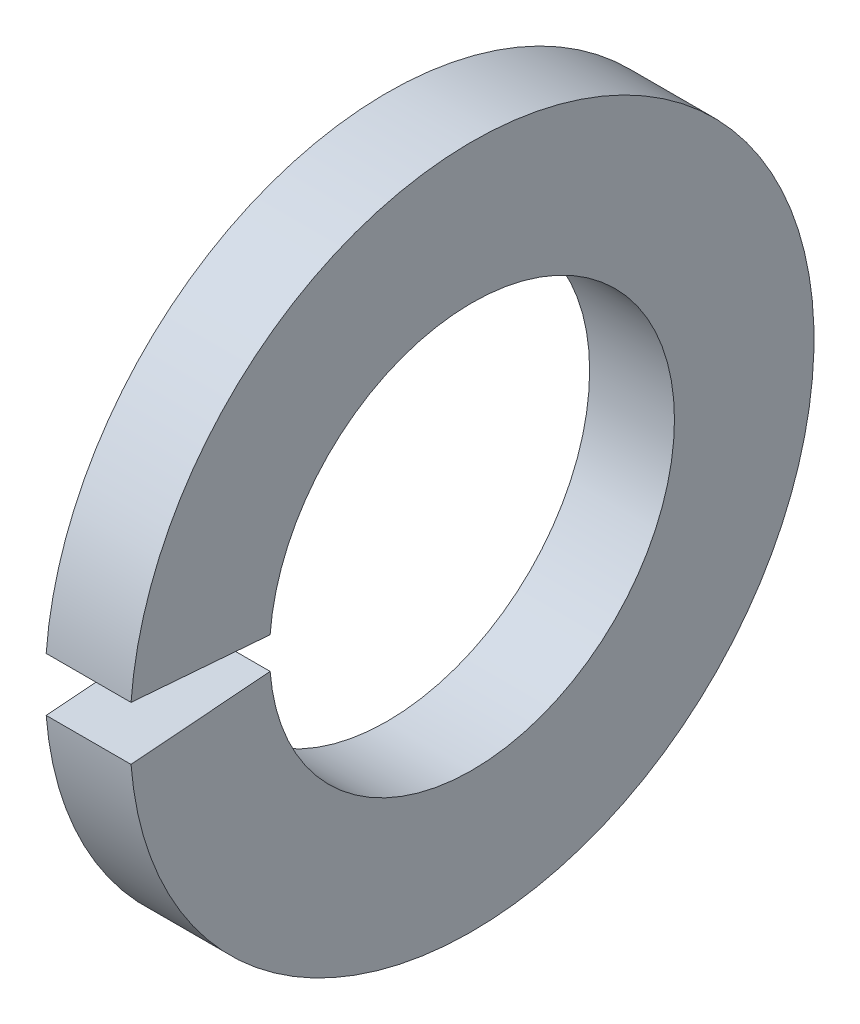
from build123d import *

# Parameters (mm, degrees)
SKETCH1_W = 0.7874
SKETCH1_H = 1.2954
GAP_DEPTH = 5.558645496


with BuildPart() as part:
    # Sketch1 → Base-Revolve (revolve)
    with BuildSketch(Plane.XY, mode=Mode.PRIVATE) as base_revolve_sk:
        with Locations((-0.3937, 2.5273)):
            Rectangle(SKETCH1_W, SKETCH1_H)
    revolve(base_revolve_sk.sketch.rotate(Axis((-34.925, 0, 0), (1, 0, 0)), 90), axis=Axis((-34.925, 0, 0), (1, 0, 0)))

    # Sketch2 → Gap (cut, through all)
    with BuildSketch(Plane(origin=(0, 0, 0), x_dir=(0, -1, 0), z_dir=(-1, 0, 0))):
        with BuildLine():
            Line((0, 0), (0.254089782, 3.228516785))
            ThreePointArc((0.254089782, 3.228516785), (0, 3.2385), (-0.254089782, 3.228516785))
            Line((-0.254089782, 3.228516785), (0, 0))
        make_face()
    extrude(amount=GAP_DEPTH, mode=Mode.SUBTRACT)


solid = part.part
